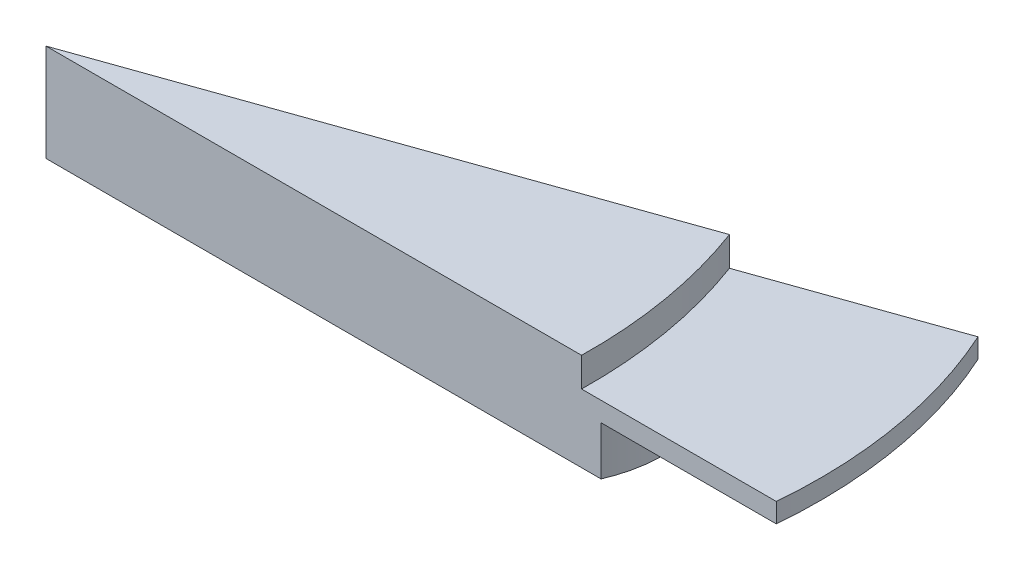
ISO-10303-21;
HEADER;
FILE_DESCRIPTION(('STEP AP214'),'2;1');
FILE_NAME('part.step','',(''),(''),'','','');
FILE_SCHEMA(('AUTOMOTIVE_DESIGN { 1 0 10303 214 1 1 1 1 }'));
ENDSEC;
DATA;
#1=APPLICATION_CONTEXT('core data for automotive mechanical design processes');
#2=APPLICATION_PROTOCOL_DEFINITION('international standard','automotive_design',2000,#1);
#3=PRODUCT_CONTEXT('',#1,'mechanical');
#4=PRODUCT('Part','Part','',(#3));
#5=PRODUCT_RELATED_PRODUCT_CATEGORY('part','',(#4));
#6=PRODUCT_DEFINITION_FORMATION('','',#4);
#7=PRODUCT_DEFINITION_CONTEXT('part definition',#1,'design');
#8=PRODUCT_DEFINITION('design','',#6,#7);
#9=PRODUCT_DEFINITION_SHAPE('','',#8);
#10=(LENGTH_UNIT() NAMED_UNIT(*) SI_UNIT(.MILLI.,.METRE.));
#11=(NAMED_UNIT(*) PLANE_ANGLE_UNIT() SI_UNIT($,.RADIAN.));
#12=(NAMED_UNIT(*) SI_UNIT($,.STERADIAN.) SOLID_ANGLE_UNIT());
#13=UNCERTAINTY_MEASURE_WITH_UNIT(LENGTH_MEASURE(1.E-05),#10,'distance_accuracy_value','');
#14=(GEOMETRIC_REPRESENTATION_CONTEXT(3) GLOBAL_UNCERTAINTY_ASSIGNED_CONTEXT((#13)) GLOBAL_UNIT_ASSIGNED_CONTEXT((#10,
#11,#12)) REPRESENTATION_CONTEXT('',''));
#15=CARTESIAN_POINT('',(0.,0.,0.));
#16=DIRECTION('',(0.,0.,1.));
#17=DIRECTION('',(1.,0.,0.));
#18=AXIS2_PLACEMENT_3D('',#15,#16,#17);
#19=CARTESIAN_POINT('',(25.1870969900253,10.,-4.32142264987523));
#20=DIRECTION('',(0.,-1.,0.));
#21=DIRECTION('',(0.,0.,-1.));
#22=AXIS2_PLACEMENT_3D('',#19,#20,#21);
#23=CYLINDRICAL_SURFACE('',#22,50.);
#24=CARTESIAN_POINT('',(25.1870969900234,5.,-4.3214226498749));
#25=DIRECTION('',(0.,-1.,0.));
#26=DIRECTION('',(0.,0.,-1.));
#27=AXIS2_PLACEMENT_3D('',#24,#25,#26);
#28=CIRCLE('',#27,50.0000000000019);
#29=CARTESIAN_POINT('',(70.7106781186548,5.,-25.));
#30=VERTEX_POINT('',#29);
#31=CARTESIAN_POINT('',(75.,5.,0.));
#32=VERTEX_POINT('',#31);
#33=EDGE_CURVE('E125',#30,#32,#28,.T.);
#34=ORIENTED_EDGE('',*,*,#33,.F.);
#35=DIRECTION('',(0.,-1.,0.));
#36=VECTOR('',#35,1.);
#37=CARTESIAN_POINT('',(70.7106781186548,10.,-25.));
#38=LINE('',#37,#36);
#39=CARTESIAN_POINT('',(70.7106781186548,7.,-25.));
#40=VERTEX_POINT('',#39);
#41=EDGE_CURVE('E123',#40,#30,#38,.T.);
#42=ORIENTED_EDGE('',*,*,#41,.F.);
#43=CARTESIAN_POINT('',(25.187096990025,7.,-4.32142264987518));
#44=DIRECTION('',(0.,1.,0.));
#45=DIRECTION('',(0.,0.,-1.));
#46=AXIS2_PLACEMENT_3D('',#43,#44,#45);
#47=CIRCLE('',#46,50.0000000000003);
#48=CARTESIAN_POINT('',(75.,7.,0.));
#49=VERTEX_POINT('',#48);
#50=EDGE_CURVE('E144',#49,#40,#47,.T.);
#51=ORIENTED_EDGE('',*,*,#50,.F.);
#52=DIRECTION('',(0.,-1.,0.));
#53=VECTOR('',#52,1.);
#54=CARTESIAN_POINT('',(75.,10.,0.));
#55=LINE('',#54,#53);
#56=EDGE_CURVE('E52',#49,#32,#55,.T.);
#57=ORIENTED_EDGE('',*,*,#56,.T.);
#58=EDGE_LOOP('',(#34,#42,#51,#57));
#59=FACE_BOUND('',#58,.T.);
#60=ADVANCED_FACE('F43',(#59),#23,.T.);
#61=CARTESIAN_POINT('',(0.,10.,0.));
#62=DIRECTION('',(0.333333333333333,0.,0.942809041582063));
#63=DIRECTION('',(0.942809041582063,0.,-0.333333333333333));
#64=AXIS2_PLACEMENT_3D('',#61,#62,#63);
#65=PLANE('',#64);
#66=DIRECTION('',(0.942809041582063,0.,-0.333333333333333));
#67=VECTOR('',#66,1.);
#68=CARTESIAN_POINT('',(49.9688792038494,5.,-17.6666666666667));
#69=LINE('',#68,#67);
#70=CARTESIAN_POINT('',(49.9688792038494,5.,-17.6666666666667));
#71=VERTEX_POINT('',#70);
#72=EDGE_CURVE('E115',#71,#30,#69,.T.);
#73=ORIENTED_EDGE('',*,*,#72,.F.);
#74=DIRECTION('',(0.,-1.,0.));
#75=VECTOR('',#74,1.);
#76=CARTESIAN_POINT('',(49.9688792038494,5.,-17.6666666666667));
#77=LINE('',#76,#75);
#78=CARTESIAN_POINT('',(49.9688792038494,0.,-17.6666666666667));
#79=VERTEX_POINT('',#78);
#80=EDGE_CURVE('E101',#71,#79,#77,.T.);
#81=ORIENTED_EDGE('',*,*,#80,.T.);
#82=DIRECTION('',(-0.942809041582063,0.,0.333333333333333));
#83=VECTOR('',#82,1.);
#84=CARTESIAN_POINT('',(0.,0.,0.));
#85=LINE('',#84,#83);
#86=CARTESIAN_POINT('',(0.,0.,0.));
#87=VERTEX_POINT('',#86);
#88=EDGE_CURVE('E156',#79,#87,#85,.T.);
#89=ORIENTED_EDGE('',*,*,#88,.T.);
#90=DIRECTION('',(0.,-1.,0.));
#91=VECTOR('',#90,1.);
#92=CARTESIAN_POINT('',(0.,10.,0.));
#93=LINE('',#92,#91);
#94=CARTESIAN_POINT('',(0.,10.,0.));
#95=VERTEX_POINT('',#94);
#96=EDGE_CURVE('E11',#95,#87,#93,.T.);
#97=ORIENTED_EDGE('',*,*,#96,.F.);
#98=DIRECTION('',(-0.942809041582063,0.,0.333333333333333));
#99=VECTOR('',#98,1.);
#100=CARTESIAN_POINT('',(0.,10.,0.));
#101=LINE('',#100,#99);
#102=CARTESIAN_POINT('',(51.8544972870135,10.,-18.3333333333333));
#103=VERTEX_POINT('',#102);
#104=EDGE_CURVE('E160',#103,#95,#101,.T.);
#105=ORIENTED_EDGE('',*,*,#104,.F.);
#106=DIRECTION('',(0.,1.,0.));
#107=VECTOR('',#106,1.);
#108=CARTESIAN_POINT('',(51.8544972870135,7.,-18.3333333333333));
#109=LINE('',#108,#107);
#110=CARTESIAN_POINT('',(51.8544972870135,7.,-18.3333333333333));
#111=VERTEX_POINT('',#110);
#112=EDGE_CURVE('E67',#111,#103,#109,.T.);
#113=ORIENTED_EDGE('',*,*,#112,.F.);
#114=DIRECTION('',(-0.942809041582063,0.,0.333333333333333));
#115=VECTOR('',#114,1.);
#116=CARTESIAN_POINT('',(51.8544972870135,7.,-18.3333333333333));
#117=LINE('',#116,#115);
#118=EDGE_CURVE('E147',#40,#111,#117,.T.);
#119=ORIENTED_EDGE('',*,*,#118,.F.);
#120=ORIENTED_EDGE('',*,*,#41,.T.);
#121=EDGE_LOOP('',(#73,#81,#89,#97,#105,#113,#119,#120));
#122=FACE_BOUND('',#121,.T.);
#123=ADVANCED_FACE('F45',(#122),#65,.F.);
#124=CARTESIAN_POINT('',(0.,10.,0.));
#125=DIRECTION('',(0.,0.,-1.));
#126=DIRECTION('',(-1.,0.,0.));
#127=AXIS2_PLACEMENT_3D('',#124,#125,#126);
#128=PLANE('',#127);
#129=DIRECTION('',(1.,0.,0.));
#130=VECTOR('',#129,1.);
#131=CARTESIAN_POINT('',(0.,0.,0.));
#132=LINE('',#131,#130);
#133=CARTESIAN_POINT('',(57.,0.,0.));
#134=VERTEX_POINT('',#133);
#135=EDGE_CURVE('E164',#87,#134,#132,.T.);
#136=ORIENTED_EDGE('',*,*,#135,.T.);
#137=DIRECTION('',(0.,-1.,0.));
#138=VECTOR('',#137,1.);
#139=CARTESIAN_POINT('',(57.,5.,0.));
#140=LINE('',#139,#138);
#141=CARTESIAN_POINT('',(57.,5.,0.));
#142=VERTEX_POINT('',#141);
#143=EDGE_CURVE('E59',#142,#134,#140,.T.);
#144=ORIENTED_EDGE('',*,*,#143,.F.);
#145=DIRECTION('',(-1.,0.,0.));
#146=VECTOR('',#145,1.);
#147=CARTESIAN_POINT('',(57.,5.,0.));
#148=LINE('',#147,#146);
#149=EDGE_CURVE('E111',#32,#142,#148,.T.);
#150=ORIENTED_EDGE('',*,*,#149,.F.);
#151=ORIENTED_EDGE('',*,*,#56,.F.);
#152=DIRECTION('',(1.,0.,0.));
#153=VECTOR('',#152,1.);
#154=CARTESIAN_POINT('',(55.,7.,0.));
#155=LINE('',#154,#153);
#156=CARTESIAN_POINT('',(55.,7.,0.));
#157=VERTEX_POINT('',#156);
#158=EDGE_CURVE('E141',#157,#49,#155,.T.);
#159=ORIENTED_EDGE('',*,*,#158,.F.);
#160=DIRECTION('',(0.,1.,0.));
#161=VECTOR('',#160,1.);
#162=CARTESIAN_POINT('',(55.,7.,0.));
#163=LINE('',#162,#161);
#164=CARTESIAN_POINT('',(55.,10.,0.));
#165=VERTEX_POINT('',#164);
#166=EDGE_CURVE('E151',#157,#165,#163,.T.);
#167=ORIENTED_EDGE('',*,*,#166,.T.);
#168=DIRECTION('',(1.,0.,0.));
#169=VECTOR('',#168,1.);
#170=CARTESIAN_POINT('',(0.,10.,0.));
#171=LINE('',#170,#169);
#172=EDGE_CURVE('E163',#95,#165,#171,.T.);
#173=ORIENTED_EDGE('',*,*,#172,.F.);
#174=ORIENTED_EDGE('',*,*,#96,.T.);
#175=EDGE_LOOP('',(#136,#144,#150,#151,#159,#167,#173,#174));
#176=FACE_BOUND('',#175,.T.);
#177=ADVANCED_FACE('F181',(#176),#128,.F.);
#178=CARTESIAN_POINT('',(25.1870969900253,10.,-4.32142264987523));
#179=DIRECTION('',(0.,-1.,0.));
#180=DIRECTION('',(0.,0.,-1.));
#181=AXIS2_PLACEMENT_3D('',#178,#179,#180);
#182=PLANE('',#181);
#183=ORIENTED_EDGE('',*,*,#172,.T.);
#184=CARTESIAN_POINT('',(5.00738160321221,10.,-0.859130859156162));
#185=DIRECTION('',(0.,-1.,0.));
#186=DIRECTION('',(0.,0.,-1.));
#187=AXIS2_PLACEMENT_3D('',#184,#185,#186);
#188=CIRCLE('',#187,50.);
#189=EDGE_CURVE('E135',#103,#165,#188,.T.);
#190=ORIENTED_EDGE('',*,*,#189,.F.);
#191=ORIENTED_EDGE('',*,*,#104,.T.);
#192=EDGE_LOOP('',(#183,#190,#191));
#193=FACE_BOUND('',#192,.T.);
#194=ADVANCED_FACE('F189',(#193),#182,.F.);
#195=CARTESIAN_POINT('',(25.1870969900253,0.,-4.32142264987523));
#196=DIRECTION('',(0.,-1.,0.));
#197=DIRECTION('',(0.,0.,-1.));
#198=AXIS2_PLACEMENT_3D('',#195,#196,#197);
#199=PLANE('',#198);
#200=CARTESIAN_POINT('',(44.6831670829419,0.,-5.33053275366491));
#201=DIRECTION('',(0.,1.,0.));
#202=DIRECTION('',(0.,0.,-1.));
#203=AXIS2_PLACEMENT_3D('',#200,#201,#202);
#204=CIRCLE('',#203,13.4208402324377);
#205=EDGE_CURVE('E106',#134,#79,#204,.T.);
#206=ORIENTED_EDGE('',*,*,#205,.F.);
#207=ORIENTED_EDGE('',*,*,#135,.F.);
#208=ORIENTED_EDGE('',*,*,#88,.F.);
#209=EDGE_LOOP('',(#206,#207,#208));
#210=FACE_BOUND('',#209,.T.);
#211=ADVANCED_FACE('F186',(#210),#199,.T.);
#212=CARTESIAN_POINT('',(5.00738160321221,7.,-0.859130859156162));
#213=DIRECTION('',(0.,1.,0.));
#214=DIRECTION('',(0.,0.,1.));
#215=AXIS2_PLACEMENT_3D('',#212,#213,#214);
#216=CYLINDRICAL_SURFACE('',#215,50.);
#217=ORIENTED_EDGE('',*,*,#189,.T.);
#218=ORIENTED_EDGE('',*,*,#166,.F.);
#219=CARTESIAN_POINT('',(5.00738160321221,7.,-0.859130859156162));
#220=DIRECTION('',(0.,-1.,0.));
#221=DIRECTION('',(0.,0.,-1.));
#222=AXIS2_PLACEMENT_3D('',#219,#220,#221);
#223=CIRCLE('',#222,50.);
#224=EDGE_CURVE('E137',#111,#157,#223,.T.);
#225=ORIENTED_EDGE('',*,*,#224,.F.);
#226=ORIENTED_EDGE('',*,*,#112,.T.);
#227=EDGE_LOOP('',(#217,#218,#225,#226));
#228=FACE_BOUND('',#227,.T.);
#229=ADVANCED_FACE('F190',(#228),#216,.T.);
#230=CARTESIAN_POINT('',(5.00738160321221,7.,-0.859130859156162));
#231=DIRECTION('',(0.,-1.,0.));
#232=DIRECTION('',(0.,0.,-1.));
#233=AXIS2_PLACEMENT_3D('',#230,#231,#232);
#234=PLANE('',#233);
#235=ORIENTED_EDGE('',*,*,#224,.T.);
#236=ORIENTED_EDGE('',*,*,#158,.T.);
#237=ORIENTED_EDGE('',*,*,#50,.T.);
#238=ORIENTED_EDGE('',*,*,#118,.T.);
#239=EDGE_LOOP('',(#235,#236,#237,#238));
#240=FACE_BOUND('',#239,.T.);
#241=ADVANCED_FACE('F192',(#240),#234,.F.);
#242=CARTESIAN_POINT('',(44.6831670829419,5.,-5.33053275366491));
#243=DIRECTION('',(0.,-1.,0.));
#244=DIRECTION('',(0.,0.,-1.));
#245=AXIS2_PLACEMENT_3D('',#242,#243,#244);
#246=CYLINDRICAL_SURFACE('',#245,13.4208402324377);
#247=ORIENTED_EDGE('',*,*,#205,.T.);
#248=ORIENTED_EDGE('',*,*,#80,.F.);
#249=CARTESIAN_POINT('',(44.6831670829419,5.,-5.33053275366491));
#250=DIRECTION('',(0.,1.,0.));
#251=DIRECTION('',(0.,0.,-1.));
#252=AXIS2_PLACEMENT_3D('',#249,#250,#251);
#253=CIRCLE('',#252,13.4208402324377);
#254=EDGE_CURVE('E104',#142,#71,#253,.T.);
#255=ORIENTED_EDGE('',*,*,#254,.F.);
#256=ORIENTED_EDGE('',*,*,#143,.T.);
#257=EDGE_LOOP('',(#247,#248,#255,#256));
#258=FACE_BOUND('',#257,.T.);
#259=ADVANCED_FACE('F103',(#258),#246,.T.);
#260=CARTESIAN_POINT('',(44.6831670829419,5.,-5.33053275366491));
#261=DIRECTION('',(0.,-1.,0.));
#262=DIRECTION('',(0.,0.,-1.));
#263=AXIS2_PLACEMENT_3D('',#260,#261,#262);
#264=PLANE('',#263);
#265=ORIENTED_EDGE('',*,*,#254,.T.);
#266=ORIENTED_EDGE('',*,*,#72,.T.);
#267=ORIENTED_EDGE('',*,*,#33,.T.);
#268=ORIENTED_EDGE('',*,*,#149,.T.);
#269=EDGE_LOOP('',(#265,#266,#267,#268));
#270=FACE_BOUND('',#269,.T.);
#271=ADVANCED_FACE('F114',(#270),#264,.T.);
#272=CLOSED_SHELL('',(#60,#123,#177,#194,#211,#229,#241,#259,#271));
#273=MANIFOLD_SOLID_BREP('B2',#272);
#274=ADVANCED_BREP_SHAPE_REPRESENTATION('',(#18,#273),#14);
#275=SHAPE_DEFINITION_REPRESENTATION(#9,#274);
ENDSEC;
END-ISO-10303-21;
